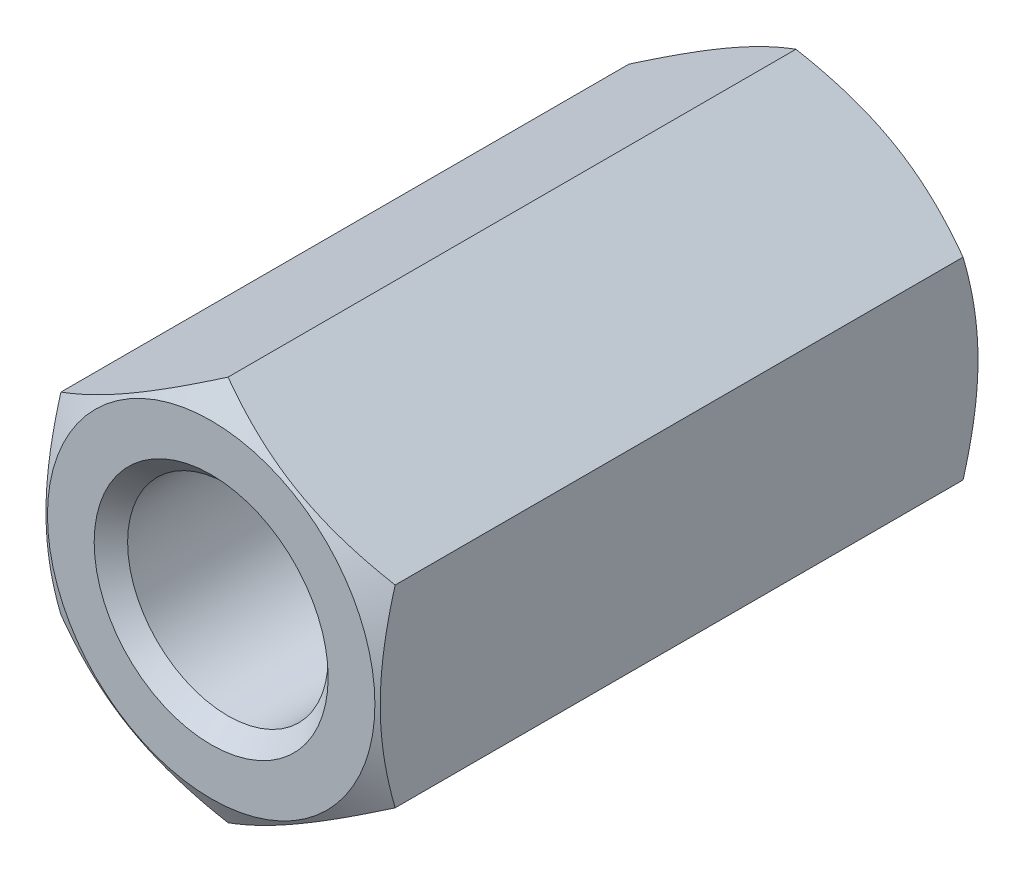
ISO-10303-21;
HEADER;
FILE_DESCRIPTION(('STEP AP214'),'2;1');
FILE_NAME('part.step','',(''),(''),'','','');
FILE_SCHEMA(('AUTOMOTIVE_DESIGN { 1 0 10303 214 1 1 1 1 }'));
ENDSEC;
DATA;
#1=APPLICATION_CONTEXT('core data for automotive mechanical design processes');
#2=APPLICATION_PROTOCOL_DEFINITION('international standard','automotive_design',2000,#1);
#3=PRODUCT_CONTEXT('',#1,'mechanical');
#4=PRODUCT('Part','Part','',(#3));
#5=PRODUCT_RELATED_PRODUCT_CATEGORY('part','',(#4));
#6=PRODUCT_DEFINITION_FORMATION('','',#4);
#7=PRODUCT_DEFINITION_CONTEXT('part definition',#1,'design');
#8=PRODUCT_DEFINITION('design','',#6,#7);
#9=PRODUCT_DEFINITION_SHAPE('','',#8);
#10=(LENGTH_UNIT() NAMED_UNIT(*) SI_UNIT(.MILLI.,.METRE.));
#11=(NAMED_UNIT(*) PLANE_ANGLE_UNIT() SI_UNIT($,.RADIAN.));
#12=(NAMED_UNIT(*) SI_UNIT($,.STERADIAN.) SOLID_ANGLE_UNIT());
#13=UNCERTAINTY_MEASURE_WITH_UNIT(LENGTH_MEASURE(1.E-05),#10,'distance_accuracy_value','');
#14=(GEOMETRIC_REPRESENTATION_CONTEXT(3) GLOBAL_UNCERTAINTY_ASSIGNED_CONTEXT((#13)) GLOBAL_UNIT_ASSIGNED_CONTEXT((#10,
#11,#12)) REPRESENTATION_CONTEXT('',''));
#15=CARTESIAN_POINT('',(0.,0.,0.));
#16=DIRECTION('',(0.,0.,1.));
#17=DIRECTION('',(1.,0.,0.));
#18=AXIS2_PLACEMENT_3D('',#15,#16,#17);
#19=CARTESIAN_POINT('',(5.,2.88675134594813,18.));
#20=DIRECTION('',(-0.5,-0.866025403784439,0.));
#21=DIRECTION('',(0.866025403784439,-0.5,0.));
#22=AXIS2_PLACEMENT_3D('',#19,#20,#21);
#23=PLANE('',#22);
#24=CARTESIAN_POINT('',(-0.00020000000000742,5.7736181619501,0.505248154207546));
#25=CARTESIAN_POINT('',(0.219534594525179,5.64675433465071,0.431986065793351));
#26=CARTESIAN_POINT('',(0.441148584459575,5.5188054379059,0.365350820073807));
#27=CARTESIAN_POINT('',(0.888213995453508,5.26069210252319,0.249038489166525));
#28=CARTESIAN_POINT('',(1.11367335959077,5.13052307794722,0.199402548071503));
#29=CARTESIAN_POINT('',(1.5618323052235,4.87177839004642,0.122150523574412));
#30=CARTESIAN_POINT('',(1.78446209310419,4.74324302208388,0.0940198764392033));
#31=CARTESIAN_POINT('',(2.11918990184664,4.54998783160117,0.0687944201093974));
#32=CARTESIAN_POINT('',(2.23084219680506,4.48552534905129,0.0632129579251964));
#33=CARTESIAN_POINT('',(2.45424997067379,4.35654081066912,0.0578017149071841));
#34=CARTESIAN_POINT('',(2.56600544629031,4.29201875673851,0.0579717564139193));
#35=CARTESIAN_POINT('',(2.87218423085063,4.11524635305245,0.0663531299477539));
#36=CARTESIAN_POINT('',(3.06650608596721,4.00305457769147,0.0804292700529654));
#37=CARTESIAN_POINT('',(3.4538601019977,3.77941563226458,0.125064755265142));
#38=CARTESIAN_POINT('',(3.64689090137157,3.66796924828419,0.15563935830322));
#39=CARTESIAN_POINT('',(4.03502534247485,3.44387972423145,0.232067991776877));
#40=CARTESIAN_POINT('',(4.23007999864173,3.33126486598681,0.278245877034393));
#41=CARTESIAN_POINT('',(4.61728034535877,3.10771464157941,0.383051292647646));
#42=CARTESIAN_POINT('',(4.80943099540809,2.99677641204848,0.441654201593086));
#43=CARTESIAN_POINT('',(5.0002,2.88663587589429,0.505248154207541));
#44=B_SPLINE_CURVE_WITH_KNOTS('',3,(#24,#25,#26,#27,#28,#29,#30,#31,#32,#33,#34,#35,#36,#37,#38,
#39,#40,#41,#42,#43),.UNSPECIFIED.,.F.,.F.,(4,2,2,2,2,2,2,2,2,4),(0.,0.792555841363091,
1.58701660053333,2.36181537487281,2.74884076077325,3.13585419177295,3.80962362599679,
4.4840172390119,5.17336882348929,5.86136694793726),.UNSPECIFIED.);
#45=CARTESIAN_POINT('',(0.,5.77350269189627,0.50518148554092));
#46=VERTEX_POINT('',#45);
#47=CARTESIAN_POINT('',(5.,2.88675134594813,0.505181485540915));
#48=VERTEX_POINT('',#47);
#49=EDGE_CURVE('E30',#46,#48,#44,.T.);
#50=ORIENTED_EDGE('',*,*,#49,.F.);
#51=DIRECTION('',(0.,0.,-1.));
#52=VECTOR('',#51,1.);
#53=CARTESIAN_POINT('',(0.,5.77350269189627,18.));
#54=LINE('',#53,#52);
#55=CARTESIAN_POINT('',(0.,5.77350269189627,17.4948185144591));
#56=VERTEX_POINT('',#55);
#57=EDGE_CURVE('E9',#56,#46,#54,.T.);
#58=ORIENTED_EDGE('',*,*,#57,.F.);
#59=CARTESIAN_POINT('',(5.0002,2.88663587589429,17.4947518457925));
#60=CARTESIAN_POINT('',(4.78046540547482,3.01349970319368,17.5680139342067));
#61=CARTESIAN_POINT('',(4.55885141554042,3.1414485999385,17.6346491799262));
#62=CARTESIAN_POINT('',(4.11178600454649,3.39956193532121,17.7509615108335));
#63=CARTESIAN_POINT('',(3.88632664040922,3.52973095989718,17.8005974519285));
#64=CARTESIAN_POINT('',(3.43816769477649,3.78847564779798,17.8778494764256));
#65=CARTESIAN_POINT('',(3.2155379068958,3.91701101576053,17.9059801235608));
#66=CARTESIAN_POINT('',(2.88081009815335,4.11026620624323,17.9312055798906));
#67=CARTESIAN_POINT('',(2.76915780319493,4.17472868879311,17.9367870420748));
#68=CARTESIAN_POINT('',(2.5457500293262,4.30371322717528,17.9421982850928));
#69=CARTESIAN_POINT('',(2.43399455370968,4.36823528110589,17.9420282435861));
#70=CARTESIAN_POINT('',(2.12781576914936,4.54500768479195,17.9336468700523));
#71=CARTESIAN_POINT('',(1.93349391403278,4.65719946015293,17.919570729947));
#72=CARTESIAN_POINT('',(1.54613989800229,4.88083840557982,17.8749352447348));
#73=CARTESIAN_POINT('',(1.35310909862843,4.99228478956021,17.8443606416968));
#74=CARTESIAN_POINT('',(0.964974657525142,5.21637431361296,17.7679320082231));
#75=CARTESIAN_POINT('',(0.76992000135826,5.32898917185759,17.7217541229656));
#76=CARTESIAN_POINT('',(0.382719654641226,5.55253939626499,17.6169487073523));
#77=CARTESIAN_POINT('',(0.190569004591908,5.66347762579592,17.5583457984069));
#78=CARTESIAN_POINT('',(-0.000200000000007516,5.7736181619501,17.4947518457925));
#79=B_SPLINE_CURVE_WITH_KNOTS('',3,(#59,#60,#61,#62,#63,#64,#65,#66,#67,#68,#69,#70,#71,#72,#73,
#74,#75,#76,#77,#78),.UNSPECIFIED.,.F.,.F.,(4,2,2,2,2,2,2,2,2,4),(0.,0.792555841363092,
1.58701660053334,2.36181537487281,2.74884076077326,3.13585419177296,3.8096236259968,
4.4840172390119,5.1733688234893,5.86136694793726),.UNSPECIFIED.);
#80=CARTESIAN_POINT('',(5.,2.88675134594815,17.4948185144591));
#81=VERTEX_POINT('',#80);
#82=EDGE_CURVE('E86',#81,#56,#79,.T.);
#83=ORIENTED_EDGE('',*,*,#82,.F.);
#84=DIRECTION('',(0.,0.,-1.));
#85=VECTOR('',#84,1.);
#86=CARTESIAN_POINT('',(5.,2.88675134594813,18.));
#87=LINE('',#86,#85);
#88=EDGE_CURVE('E79',#81,#48,#87,.T.);
#89=ORIENTED_EDGE('',*,*,#88,.T.);
#90=EDGE_LOOP('',(#50,#58,#83,#89));
#91=FACE_BOUND('',#90,.T.);
#92=ADVANCED_FACE('F14',(#91),#23,.F.);
#93=CARTESIAN_POINT('',(0.,5.77350269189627,18.));
#94=DIRECTION('',(0.5,-0.866025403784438,0.));
#95=DIRECTION('',(0.866025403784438,0.5,0.));
#96=AXIS2_PLACEMENT_3D('',#93,#94,#95);
#97=PLANE('',#96);
#98=CARTESIAN_POINT('',(-5.0002,2.88663587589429,0.505248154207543));
#99=CARTESIAN_POINT('',(-4.78046540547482,3.01349970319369,0.431986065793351));
#100=CARTESIAN_POINT('',(-4.55885141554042,3.1414485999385,0.365350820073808));
#101=CARTESIAN_POINT('',(-4.11178600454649,3.39956193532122,0.249038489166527));
#102=CARTESIAN_POINT('',(-3.88632664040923,3.52973095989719,0.199402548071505));
#103=CARTESIAN_POINT('',(-3.43816769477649,3.78847564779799,0.122150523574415));
#104=CARTESIAN_POINT('',(-3.21553790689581,3.91701101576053,0.0940198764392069));
#105=CARTESIAN_POINT('',(-2.88081009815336,4.11026620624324,0.0687944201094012));
#106=CARTESIAN_POINT('',(-2.76915780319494,4.17472868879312,0.0632129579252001));
#107=CARTESIAN_POINT('',(-2.5457500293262,4.30371322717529,0.0578017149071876));
#108=CARTESIAN_POINT('',(-2.43399455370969,4.3682352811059,0.0579717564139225));
#109=CARTESIAN_POINT('',(-2.12781576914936,4.54500768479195,0.0663531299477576));
#110=CARTESIAN_POINT('',(-1.93349391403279,4.65719946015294,0.0804292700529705));
#111=CARTESIAN_POINT('',(-1.5461398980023,4.88083840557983,0.125064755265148));
#112=CARTESIAN_POINT('',(-1.35310909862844,4.99228478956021,0.155639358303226));
#113=CARTESIAN_POINT('',(-0.964974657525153,5.21637431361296,0.232067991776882));
#114=CARTESIAN_POINT('',(-0.769920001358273,5.3289891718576,0.278245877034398));
#115=CARTESIAN_POINT('',(-0.382719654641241,5.55253939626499,0.383051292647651));
#116=CARTESIAN_POINT('',(-0.190569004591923,5.66347762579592,0.441654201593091));
#117=CARTESIAN_POINT('',(0.000199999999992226,5.7736181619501,0.505248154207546));
#118=B_SPLINE_CURVE_WITH_KNOTS('',3,(#98,#99,#100,#101,#102,#103,#104,#105,#106,#107,#108,#109,
#110,#111,#112,#113,#114,#115,#116,#117),.UNSPECIFIED.,.F.,.F.,(4,2,2,2,2,2,2,2,2,4),(0.,
0.792555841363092,1.58701660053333,2.36181537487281,2.74884076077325,3.13585419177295,
3.80962362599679,4.48401723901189,5.17336882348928,5.86136694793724),.UNSPECIFIED.);
#119=CARTESIAN_POINT('',(-5.,2.88675134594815,0.50518148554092));
#120=VERTEX_POINT('',#119);
#121=EDGE_CURVE('E66',#120,#46,#118,.T.);
#122=ORIENTED_EDGE('',*,*,#121,.F.);
#123=DIRECTION('',(0.,0.,-1.));
#124=VECTOR('',#123,1.);
#125=CARTESIAN_POINT('',(-5.,2.88675134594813,18.));
#126=LINE('',#125,#124);
#127=CARTESIAN_POINT('',(-5.,2.88675134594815,17.4948185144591));
#128=VERTEX_POINT('',#127);
#129=EDGE_CURVE('E23',#128,#120,#126,.T.);
#130=ORIENTED_EDGE('',*,*,#129,.F.);
#131=CARTESIAN_POINT('',(0.00019999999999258,5.7736181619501,17.4947518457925));
#132=CARTESIAN_POINT('',(-0.219534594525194,5.64675433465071,17.5680139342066));
#133=CARTESIAN_POINT('',(-0.44114858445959,5.51880543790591,17.6346491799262));
#134=CARTESIAN_POINT('',(-0.888213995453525,5.26069210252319,17.7509615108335));
#135=CARTESIAN_POINT('',(-1.11367335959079,5.13052307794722,17.8005974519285));
#136=CARTESIAN_POINT('',(-1.56183230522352,4.87177839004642,17.8778494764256));
#137=CARTESIAN_POINT('',(-1.7844620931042,4.74324302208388,17.9059801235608));
#138=CARTESIAN_POINT('',(-2.11918990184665,4.54998783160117,17.9312055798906));
#139=CARTESIAN_POINT('',(-2.23084219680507,4.48552534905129,17.9367870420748));
#140=CARTESIAN_POINT('',(-2.45424997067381,4.35654081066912,17.9421982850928));
#141=CARTESIAN_POINT('',(-2.56600544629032,4.29201875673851,17.9420282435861));
#142=CARTESIAN_POINT('',(-2.87218423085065,4.11524635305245,17.9336468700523));
#143=CARTESIAN_POINT('',(-3.06650608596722,4.00305457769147,17.919570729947));
#144=CARTESIAN_POINT('',(-3.45386010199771,3.77941563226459,17.8749352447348));
#145=CARTESIAN_POINT('',(-3.64689090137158,3.6679692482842,17.8443606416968));
#146=CARTESIAN_POINT('',(-4.03502534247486,3.44387972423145,17.7679320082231));
#147=CARTESIAN_POINT('',(-4.23007999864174,3.33126486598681,17.7217541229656));
#148=CARTESIAN_POINT('',(-4.61728034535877,3.10771464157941,17.6169487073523));
#149=CARTESIAN_POINT('',(-4.80943099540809,2.99677641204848,17.5583457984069));
#150=CARTESIAN_POINT('',(-5.0002,2.88663587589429,17.4947518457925));
#151=B_SPLINE_CURVE_WITH_KNOTS('',3,(#131,#132,#133,#134,#135,#136,#137,#138,#139,#140,#141,
#142,#143,#144,#145,#146,#147,#148,#149,#150),.UNSPECIFIED.,.F.,.F.,(4,2,2,2,2,2,2,2,2,4),(0.,
0.792555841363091,1.58701660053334,2.36181537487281,2.74884076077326,3.13585419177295,
3.80962362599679,4.48401723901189,5.17336882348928,5.86136694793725),.UNSPECIFIED.);
#152=EDGE_CURVE('E84',#56,#128,#151,.T.);
#153=ORIENTED_EDGE('',*,*,#152,.F.);
#154=ORIENTED_EDGE('',*,*,#57,.T.);
#155=EDGE_LOOP('',(#122,#130,#153,#154));
#156=FACE_BOUND('',#155,.T.);
#157=ADVANCED_FACE('F83',(#156),#97,.F.);
#158=CARTESIAN_POINT('',(-5.,2.88675134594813,18.));
#159=DIRECTION('',(1.,0.,0.));
#160=DIRECTION('',(0.,1.,0.));
#161=AXIS2_PLACEMENT_3D('',#158,#159,#160);
#162=PLANE('',#161);
#163=CARTESIAN_POINT('',(-5.,-7.64796514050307,2.44730613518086));
#164=CARTESIAN_POINT('',(-5.,-7.42850000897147,2.34128222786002));
#165=CARTESIAN_POINT('',(-5.00000000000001,-7.20851506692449,2.236314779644));
#166=CARTESIAN_POINT('',(-5.00000000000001,-6.7672244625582,2.02909668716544));
#167=CARTESIAN_POINT('',(-5.00000000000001,-6.54591857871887,1.92684651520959));
#168=CARTESIAN_POINT('',(-5.00000000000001,-6.1005054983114,1.72512642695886));
#169=CARTESIAN_POINT('',(-5.00000000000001,-5.87638951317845,1.62567584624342));
#170=CARTESIAN_POINT('',(-5.00000000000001,-5.42631248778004,1.43105805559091));
#171=CARTESIAN_POINT('',(-5.,-5.20035154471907,1.33589062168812));
#172=CARTESIAN_POINT('',(-5.,-4.74345800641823,1.14986406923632));
#173=CARTESIAN_POINT('',(-5.,-4.51249834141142,1.05907107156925));
#174=CARTESIAN_POINT('',(-5.,-4.04785175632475,0.884616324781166));
#175=CARTESIAN_POINT('',(-5.,-3.81416453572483,0.800955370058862));
#176=CARTESIAN_POINT('',(-5.,-3.34417457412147,0.643018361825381));
#177=CARTESIAN_POINT('',(-5.,-3.10787863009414,0.568722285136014));
#178=CARTESIAN_POINT('',(-5.,-2.63192544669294,0.431934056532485));
#179=CARTESIAN_POINT('',(-5.,-2.39226929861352,0.369438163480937));
#180=CARTESIAN_POINT('',(-5.,-1.90944023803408,0.259285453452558));
#181=CARTESIAN_POINT('',(-5.,-1.66626630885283,0.211633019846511));
#182=CARTESIAN_POINT('',(-5.,-1.17696169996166,0.134394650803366));
#183=CARTESIAN_POINT('',(-5.,-0.930831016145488,0.10480874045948));
#184=CARTESIAN_POINT('',(-5.,-0.561248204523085,0.0758765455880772));
#185=CARTESIAN_POINT('',(-5.,-0.438369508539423,0.0688052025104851));
#186=CARTESIAN_POINT('',(-5.,-0.192417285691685,0.059868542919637));
#187=CARTESIAN_POINT('',(-5.,-0.0693437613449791,0.0580031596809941));
#188=CARTESIAN_POINT('',(-5.,0.176735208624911,0.0595287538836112));
#189=CARTESIAN_POINT('',(-5.,0.299740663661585,0.0629182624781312));
#190=CARTESIAN_POINT('',(-5.,0.545502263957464,0.074868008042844));
#191=CARTESIAN_POINT('',(-5.,0.668258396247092,0.0834285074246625));
#192=CARTESIAN_POINT('',(-5.,0.966054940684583,0.110290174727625));
#193=CARTESIAN_POINT('',(-5.,1.14086404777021,0.131197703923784));
#194=CARTESIAN_POINT('',(-5.,1.48911279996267,0.182333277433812));
#195=CARTESIAN_POINT('',(-5.,1.66255225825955,0.212562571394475));
#196=CARTESIAN_POINT('',(-5.,2.00795437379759,0.281272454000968));
#197=CARTESIAN_POINT('',(-5.,2.17991537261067,0.319761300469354));
#198=CARTESIAN_POINT('',(-5.,2.52207129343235,0.403816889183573));
#199=CARTESIAN_POINT('',(-5.,2.69226632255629,0.449383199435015));
#200=CARTESIAN_POINT('',(-5.,3.03506218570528,0.547690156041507));
#201=CARTESIAN_POINT('',(-5.,3.2076202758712,0.600578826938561));
#202=CARTESIAN_POINT('',(-5.,3.55091234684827,0.711564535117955));
#203=CARTESIAN_POINT('',(-5.,3.72164749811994,0.769657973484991));
#204=CARTESIAN_POINT('',(-5.,4.06060843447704,0.88985469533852));
#205=CARTESIAN_POINT('',(-5.,4.22884293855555,0.951933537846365));
#206=CARTESIAN_POINT('',(-5.,4.56400815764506,1.07972371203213));
#207=CARTESIAN_POINT('',(-5.,4.73093831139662,1.14543651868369));
#208=CARTESIAN_POINT('',(-5.,4.89726279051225,1.21260644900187));
#209=B_SPLINE_CURVE_WITH_KNOTS('',3,(#163,#164,#165,#166,#167,#168,#169,#170,#171,#172,#173,
#174,#175,#176,#177,#178,#179,#180,#181,#182,#183,#184,#185,#186,#187,#188,#189,#190,#191,#192,
#193,#194,#195,#196,#197,#198,#199,#200,#201,#202,#203,#204,#205,#206,#207,#208),.UNSPECIFIED.,
.F.,.F.,(4,2,2,2,2,2,2,2,2,2,2,2,2,2,2,2,2,2,2,2,2,2,4),(0.,0.731210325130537,1.46254692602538,
2.19808288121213,2.93358033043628,3.67798361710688,4.42246971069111,5.16533598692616,
5.90796634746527,6.65081580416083,7.39366629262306,7.76281858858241,8.13196615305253,
8.5010105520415,8.87007368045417,9.39794425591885,9.92588562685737,10.4543573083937,
10.9827967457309,11.5241406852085,12.0651131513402,12.6030371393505,13.1411810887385),.UNSPECIFIED.);
#210=CARTESIAN_POINT('',(-5.,-2.88675134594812,0.50518148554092));
#211=VERTEX_POINT('',#210);
#212=EDGE_CURVE('E69',#211,#120,#209,.T.);
#213=ORIENTED_EDGE('',*,*,#212,.F.);
#214=DIRECTION('',(0.,0.,-1.));
#215=VECTOR('',#214,1.);
#216=CARTESIAN_POINT('',(-5.,-2.88675134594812,18.));
#217=LINE('',#216,#215);
#218=CARTESIAN_POINT('',(-5.,-2.88675134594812,17.4948185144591));
#219=VERTEX_POINT('',#218);
#220=EDGE_CURVE('E192',#219,#211,#217,.T.);
#221=ORIENTED_EDGE('',*,*,#220,.F.);
#222=CARTESIAN_POINT('',(-5.,-7.64796514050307,15.5526938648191));
#223=CARTESIAN_POINT('',(-5.,-7.42850000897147,15.65871777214));
#224=CARTESIAN_POINT('',(-5.00000000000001,-7.20851506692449,15.763685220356));
#225=CARTESIAN_POINT('',(-5.00000000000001,-6.76722446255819,15.9709033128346));
#226=CARTESIAN_POINT('',(-5.00000000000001,-6.54591857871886,16.0731534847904));
#227=CARTESIAN_POINT('',(-5.00000000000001,-6.10050549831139,16.2748735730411));
#228=CARTESIAN_POINT('',(-5.00000000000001,-5.87638951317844,16.3743241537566));
#229=CARTESIAN_POINT('',(-5.00000000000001,-5.42631248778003,16.5689419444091));
#230=CARTESIAN_POINT('',(-5.,-5.20035154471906,16.6641093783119));
#231=CARTESIAN_POINT('',(-5.,-4.74345800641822,16.8501359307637));
#232=CARTESIAN_POINT('',(-5.,-4.51249834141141,16.9409289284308));
#233=CARTESIAN_POINT('',(-5.,-4.04785175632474,17.1153836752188));
#234=CARTESIAN_POINT('',(-5.,-3.81416453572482,17.1990446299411));
#235=CARTESIAN_POINT('',(-5.,-3.34417457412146,17.3569816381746));
#236=CARTESIAN_POINT('',(-5.,-3.10787863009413,17.431277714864));
#237=CARTESIAN_POINT('',(-5.,-2.63192544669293,17.5680659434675));
#238=CARTESIAN_POINT('',(-5.,-2.39226929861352,17.6305618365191));
#239=CARTESIAN_POINT('',(-5.,-1.90944023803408,17.7407145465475));
#240=CARTESIAN_POINT('',(-5.,-1.66626630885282,17.7883669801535));
#241=CARTESIAN_POINT('',(-5.,-1.17696169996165,17.8656053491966));
#242=CARTESIAN_POINT('',(-5.,-0.930831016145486,17.8951912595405));
#243=CARTESIAN_POINT('',(-5.,-0.561248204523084,17.9241234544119));
#244=CARTESIAN_POINT('',(-5.,-0.438369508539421,17.9311947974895));
#245=CARTESIAN_POINT('',(-5.,-0.192417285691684,17.9401314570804));
#246=CARTESIAN_POINT('',(-5.,-0.0693437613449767,17.941996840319));
#247=CARTESIAN_POINT('',(-5.,0.176735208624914,17.9404712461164));
#248=CARTESIAN_POINT('',(-5.,0.299740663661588,17.9370817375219));
#249=CARTESIAN_POINT('',(-5.,0.545502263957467,17.9251319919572));
#250=CARTESIAN_POINT('',(-5.,0.668258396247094,17.9165714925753));
#251=CARTESIAN_POINT('',(-5.,0.966054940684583,17.8897098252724));
#252=CARTESIAN_POINT('',(-5.,1.14086404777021,17.8688022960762));
#253=CARTESIAN_POINT('',(-5.,1.48911279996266,17.8176667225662));
#254=CARTESIAN_POINT('',(-5.,1.66255225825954,17.7874374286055));
#255=CARTESIAN_POINT('',(-5.,2.00795437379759,17.718727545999));
#256=CARTESIAN_POINT('',(-5.,2.17991537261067,17.6802386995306));
#257=CARTESIAN_POINT('',(-5.,2.52207129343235,17.5961831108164));
#258=CARTESIAN_POINT('',(-5.,2.69226632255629,17.550616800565));
#259=CARTESIAN_POINT('',(-5.,3.03506218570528,17.4523098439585));
#260=CARTESIAN_POINT('',(-5.,3.20762027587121,17.3994211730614));
#261=CARTESIAN_POINT('',(-5.,3.55091234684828,17.288435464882));
#262=CARTESIAN_POINT('',(-5.,3.72164749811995,17.230342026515));
#263=CARTESIAN_POINT('',(-5.,4.06060843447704,17.1101453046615));
#264=CARTESIAN_POINT('',(-5.,4.22884293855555,17.0480664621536));
#265=CARTESIAN_POINT('',(-5.,4.56400815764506,16.9202762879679));
#266=CARTESIAN_POINT('',(-5.,4.73093831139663,16.8545634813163));
#267=CARTESIAN_POINT('',(-5.,4.89726279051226,16.7873935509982));
#268=B_SPLINE_CURVE_WITH_KNOTS('',3,(#222,#223,#224,#225,#226,#227,#228,#229,#230,#231,#232,
#233,#234,#235,#236,#237,#238,#239,#240,#241,#242,#243,#244,#245,#246,#247,#248,#249,#250,#251,
#252,#253,#254,#255,#256,#257,#258,#259,#260,#261,#262,#263,#264,#265,#266,#267),.UNSPECIFIED.,
.F.,.F.,(4,2,2,2,2,2,2,2,2,2,2,2,2,2,2,2,2,2,2,2,2,2,4),(0.,0.731210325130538,1.46254692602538,
2.19808288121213,2.93358033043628,3.67798361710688,4.42246971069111,5.16533598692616,
5.90796634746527,6.65081580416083,7.39366629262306,7.76281858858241,8.13196615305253,
8.5010105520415,8.87007368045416,9.39794425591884,9.92588562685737,10.4543573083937,
10.9827967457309,11.5241406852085,12.0651131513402,12.6030371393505,13.1411810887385),.UNSPECIFIED.);
#269=EDGE_CURVE('E87',#128,#219,#268,.F.);
#270=ORIENTED_EDGE('',*,*,#269,.F.);
#271=ORIENTED_EDGE('',*,*,#129,.T.);
#272=EDGE_LOOP('',(#213,#221,#270,#271));
#273=FACE_BOUND('',#272,.T.);
#274=ADVANCED_FACE('F148',(#273),#162,.F.);
#275=CARTESIAN_POINT('',(-5.,-2.88675134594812,18.));
#276=DIRECTION('',(0.5,0.866025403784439,0.));
#277=DIRECTION('',(-0.866025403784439,0.5,0.));
#278=AXIS2_PLACEMENT_3D('',#275,#276,#277);
#279=PLANE('',#278);
#280=CARTESIAN_POINT('',(0.000199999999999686,-5.77361816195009,0.50524815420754));
#281=CARTESIAN_POINT('',(-0.219534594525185,-5.6467543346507,0.431986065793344));
#282=CARTESIAN_POINT('',(-0.44114858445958,-5.51880543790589,0.3653508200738));
#283=CARTESIAN_POINT('',(-0.888213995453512,-5.26069210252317,0.249038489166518));
#284=CARTESIAN_POINT('',(-1.11367335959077,-5.13052307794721,0.199402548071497));
#285=CARTESIAN_POINT('',(-1.56183230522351,-4.87177839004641,0.122150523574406));
#286=CARTESIAN_POINT('',(-1.78446209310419,-4.74324302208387,0.094019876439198));
#287=CARTESIAN_POINT('',(-2.11918990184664,-4.54998783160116,0.0687944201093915));
#288=CARTESIAN_POINT('',(-2.23084219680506,-4.48552534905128,0.0632129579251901));
#289=CARTESIAN_POINT('',(-2.4542499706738,-4.35654081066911,0.0578017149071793));
#290=CARTESIAN_POINT('',(-2.56600544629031,-4.2920187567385,0.0579717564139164));
#291=CARTESIAN_POINT('',(-2.87218423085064,-4.11524635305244,0.0663531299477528));
#292=CARTESIAN_POINT('',(-3.06650608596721,-4.00305457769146,0.0804292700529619));
#293=CARTESIAN_POINT('',(-3.45386010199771,-3.77941563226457,0.125064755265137));
#294=CARTESIAN_POINT('',(-3.64689090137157,-3.66796924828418,0.155639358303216));
#295=CARTESIAN_POINT('',(-4.03502534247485,-3.44387972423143,0.232067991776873));
#296=CARTESIAN_POINT('',(-4.23007999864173,-3.3312648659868,0.278245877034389));
#297=CARTESIAN_POINT('',(-4.61728034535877,-3.1077146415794,0.383051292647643));
#298=CARTESIAN_POINT('',(-4.80943099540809,-2.99677641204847,0.441654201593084));
#299=CARTESIAN_POINT('',(-5.0002,-2.88663587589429,0.505248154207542));
#300=B_SPLINE_CURVE_WITH_KNOTS('',3,(#280,#281,#282,#283,#284,#285,#286,#287,#288,#289,#290,
#291,#292,#293,#294,#295,#296,#297,#298,#299),.UNSPECIFIED.,.F.,.F.,(4,2,2,2,2,2,2,2,2,4),(0.,
0.79255584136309,1.58701660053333,2.3618153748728,2.74884076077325,3.13585419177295,
3.80962362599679,4.48401723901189,5.17336882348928,5.86136694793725),.UNSPECIFIED.);
#301=CARTESIAN_POINT('',(0.,-5.77350269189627,0.50518148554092));
#302=VERTEX_POINT('',#301);
#303=EDGE_CURVE('E154',#302,#211,#300,.T.);
#304=ORIENTED_EDGE('',*,*,#303,.F.);
#305=DIRECTION('',(0.,0.,-1.));
#306=VECTOR('',#305,1.);
#307=CARTESIAN_POINT('',(0.,-5.77350269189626,18.));
#308=LINE('',#307,#306);
#309=CARTESIAN_POINT('',(0.,-5.77350269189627,17.4948185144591));
#310=VERTEX_POINT('',#309);
#311=EDGE_CURVE('E187',#310,#302,#308,.T.);
#312=ORIENTED_EDGE('',*,*,#311,.F.);
#313=CARTESIAN_POINT('',(-5.0002,-2.88663587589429,17.4947518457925));
#314=CARTESIAN_POINT('',(-4.78046540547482,-3.01349970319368,17.5680139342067));
#315=CARTESIAN_POINT('',(-4.55885141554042,-3.14144859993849,17.6346491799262));
#316=CARTESIAN_POINT('',(-4.11178600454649,-3.3995619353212,17.7509615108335));
#317=CARTESIAN_POINT('',(-3.88632664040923,-3.52973095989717,17.8005974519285));
#318=CARTESIAN_POINT('',(-3.43816769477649,-3.78847564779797,17.8778494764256));
#319=CARTESIAN_POINT('',(-3.21553790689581,-3.91701101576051,17.9059801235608));
#320=CARTESIAN_POINT('',(-2.88081009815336,-4.11026620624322,17.9312055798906));
#321=CARTESIAN_POINT('',(-2.76915780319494,-4.1747286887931,17.9367870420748));
#322=CARTESIAN_POINT('',(-2.54575002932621,-4.30371322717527,17.9421982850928));
#323=CARTESIAN_POINT('',(-2.43399455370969,-4.36823528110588,17.9420282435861));
#324=CARTESIAN_POINT('',(-2.12781576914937,-4.54500768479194,17.9336468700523));
#325=CARTESIAN_POINT('',(-1.93349391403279,-4.65719946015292,17.919570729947));
#326=CARTESIAN_POINT('',(-1.5461398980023,-4.8808384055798,17.8749352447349));
#327=CARTESIAN_POINT('',(-1.35310909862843,-4.9922847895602,17.8443606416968));
#328=CARTESIAN_POINT('',(-0.964974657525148,-5.21637431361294,17.7679320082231));
#329=CARTESIAN_POINT('',(-0.769920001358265,-5.32898917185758,17.7217541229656));
#330=CARTESIAN_POINT('',(-0.382719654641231,-5.55253939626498,17.6169487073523));
#331=CARTESIAN_POINT('',(-0.190569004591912,-5.66347762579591,17.5583457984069));
#332=CARTESIAN_POINT('',(0.000200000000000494,-5.77361816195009,17.4947518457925));
#333=B_SPLINE_CURVE_WITH_KNOTS('',3,(#313,#314,#315,#316,#317,#318,#319,#320,#321,#322,#323,
#324,#325,#326,#327,#328,#329,#330,#331,#332),.UNSPECIFIED.,.F.,.F.,(4,2,2,2,2,2,2,2,2,4),(0.,
0.79255584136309,1.58701660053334,2.3618153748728,2.74884076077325,3.13585419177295,
3.80962362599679,4.48401723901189,5.17336882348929,5.86136694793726),.UNSPECIFIED.);
#334=EDGE_CURVE('E90',#219,#310,#333,.T.);
#335=ORIENTED_EDGE('',*,*,#334,.F.);
#336=ORIENTED_EDGE('',*,*,#220,.T.);
#337=EDGE_LOOP('',(#304,#312,#335,#336));
#338=FACE_BOUND('',#337,.T.);
#339=ADVANCED_FACE('F144',(#338),#279,.F.);
#340=CARTESIAN_POINT('',(0.,-5.77350269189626,18.));
#341=DIRECTION('',(-0.5,0.866025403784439,0.));
#342=DIRECTION('',(-0.866025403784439,-0.5,0.));
#343=AXIS2_PLACEMENT_3D('',#340,#341,#342);
#344=PLANE('',#343);
#345=CARTESIAN_POINT('',(5.0002,-2.88663587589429,0.505248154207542));
#346=CARTESIAN_POINT('',(4.78046540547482,-3.01349970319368,0.431986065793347));
#347=CARTESIAN_POINT('',(4.55885141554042,-3.14144859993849,0.365350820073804));
#348=CARTESIAN_POINT('',(4.11178600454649,-3.39956193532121,0.249038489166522));
#349=CARTESIAN_POINT('',(3.88632664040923,-3.52973095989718,0.1994025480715));
#350=CARTESIAN_POINT('',(3.43816769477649,-3.78847564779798,0.12215052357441));
#351=CARTESIAN_POINT('',(3.21553790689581,-3.91701101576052,0.0940198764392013));
#352=CARTESIAN_POINT('',(2.88081009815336,-4.11026620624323,0.0687944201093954));
#353=CARTESIAN_POINT('',(2.76915780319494,-4.17472868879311,0.0632129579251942));
#354=CARTESIAN_POINT('',(2.5457500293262,-4.30371322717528,0.0578017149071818));
#355=CARTESIAN_POINT('',(2.43399455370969,-4.36823528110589,0.0579717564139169));
#356=CARTESIAN_POINT('',(2.12781576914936,-4.54500768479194,0.066353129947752));
#357=CARTESIAN_POINT('',(1.93349391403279,-4.65719946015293,0.0804292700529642));
#358=CARTESIAN_POINT('',(1.5461398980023,-4.88083840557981,0.125064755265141));
#359=CARTESIAN_POINT('',(1.35310909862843,-4.9922847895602,0.155639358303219));
#360=CARTESIAN_POINT('',(0.964974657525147,-5.21637431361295,0.232067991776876));
#361=CARTESIAN_POINT('',(0.769920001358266,-5.32898917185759,0.278245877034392));
#362=CARTESIAN_POINT('',(0.382719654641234,-5.55253939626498,0.383051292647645));
#363=CARTESIAN_POINT('',(0.190569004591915,-5.66347762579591,0.441654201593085));
#364=CARTESIAN_POINT('',(-0.000200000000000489,-5.77361816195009,0.50524815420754));
#365=B_SPLINE_CURVE_WITH_KNOTS('',3,(#345,#346,#347,#348,#349,#350,#351,#352,#353,#354,#355,
#356,#357,#358,#359,#360,#361,#362,#363,#364),.UNSPECIFIED.,.F.,.F.,(4,2,2,2,2,2,2,2,2,4),(0.,
0.792555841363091,1.58701660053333,2.36181537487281,2.74884076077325,3.13585419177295,
3.80962362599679,4.48401723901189,5.17336882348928,5.86136694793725),.UNSPECIFIED.);
#366=CARTESIAN_POINT('',(5.,-2.88675134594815,0.50518148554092));
#367=VERTEX_POINT('',#366);
#368=EDGE_CURVE('E161',#367,#302,#365,.T.);
#369=ORIENTED_EDGE('',*,*,#368,.F.);
#370=DIRECTION('',(0.,0.,-1.));
#371=VECTOR('',#370,1.);
#372=CARTESIAN_POINT('',(5.,-2.88675134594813,18.));
#373=LINE('',#372,#371);
#374=CARTESIAN_POINT('',(5.,-2.88675134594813,17.4948185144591));
#375=VERTEX_POINT('',#374);
#376=EDGE_CURVE('E186',#375,#367,#373,.T.);
#377=ORIENTED_EDGE('',*,*,#376,.F.);
#378=CARTESIAN_POINT('',(-0.000200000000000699,-5.77361816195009,17.4947518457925));
#379=CARTESIAN_POINT('',(0.219534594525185,-5.6467543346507,17.5680139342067));
#380=CARTESIAN_POINT('',(0.441148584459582,-5.5188054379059,17.6346491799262));
#381=CARTESIAN_POINT('',(0.888213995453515,-5.26069210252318,17.7509615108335));
#382=CARTESIAN_POINT('',(1.11367335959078,-5.13052307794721,17.8005974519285));
#383=CARTESIAN_POINT('',(1.56183230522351,-4.87177839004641,17.8778494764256));
#384=CARTESIAN_POINT('',(1.78446209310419,-4.74324302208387,17.9059801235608));
#385=CARTESIAN_POINT('',(2.11918990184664,-4.54998783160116,17.9312055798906));
#386=CARTESIAN_POINT('',(2.23084219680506,-4.48552534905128,17.9367870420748));
#387=CARTESIAN_POINT('',(2.4542499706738,-4.35654081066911,17.9421982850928));
#388=CARTESIAN_POINT('',(2.56600544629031,-4.2920187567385,17.9420282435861));
#389=CARTESIAN_POINT('',(2.87218423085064,-4.11524635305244,17.9336468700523));
#390=CARTESIAN_POINT('',(3.06650608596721,-4.00305457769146,17.919570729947));
#391=CARTESIAN_POINT('',(3.4538601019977,-3.77941563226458,17.8749352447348));
#392=CARTESIAN_POINT('',(3.64689090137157,-3.66796924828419,17.8443606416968));
#393=CARTESIAN_POINT('',(4.03502534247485,-3.44387972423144,17.7679320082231));
#394=CARTESIAN_POINT('',(4.23007999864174,-3.3312648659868,17.7217541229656));
#395=CARTESIAN_POINT('',(4.61728034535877,-3.10771464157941,17.6169487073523));
#396=CARTESIAN_POINT('',(4.80943099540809,-2.99677641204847,17.5583457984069));
#397=CARTESIAN_POINT('',(5.0002,-2.88663587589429,17.4947518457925));
#398=B_SPLINE_CURVE_WITH_KNOTS('',3,(#378,#379,#380,#381,#382,#383,#384,#385,#386,#387,#388,
#389,#390,#391,#392,#393,#394,#395,#396,#397),.UNSPECIFIED.,.F.,.F.,(4,2,2,2,2,2,2,2,2,4),(0.,
0.792555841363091,1.58701660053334,2.36181537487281,2.74884076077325,3.13585419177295,
3.80962362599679,4.48401723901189,5.17336882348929,5.86136694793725),.UNSPECIFIED.);
#399=EDGE_CURVE('E38',#310,#375,#398,.T.);
#400=ORIENTED_EDGE('',*,*,#399,.F.);
#401=ORIENTED_EDGE('',*,*,#311,.T.);
#402=EDGE_LOOP('',(#369,#377,#400,#401));
#403=FACE_BOUND('',#402,.T.);
#404=ADVANCED_FACE('F147',(#403),#344,.F.);
#405=CARTESIAN_POINT('',(5.,-2.88675134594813,18.));
#406=DIRECTION('',(-1.,0.,0.));
#407=DIRECTION('',(0.,-1.,0.));
#408=AXIS2_PLACEMENT_3D('',#405,#406,#407);
#409=PLANE('',#408);
#410=CARTESIAN_POINT('',(5.,-7.64796514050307,2.44730613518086));
#411=CARTESIAN_POINT('',(5.,-7.42850000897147,2.34128222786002));
#412=CARTESIAN_POINT('',(5.,-7.20851506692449,2.236314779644));
#413=CARTESIAN_POINT('',(5.,-6.7672244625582,2.02909668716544));
#414=CARTESIAN_POINT('',(5.,-6.54591857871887,1.92684651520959));
#415=CARTESIAN_POINT('',(5.,-6.1005054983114,1.72512642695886));
#416=CARTESIAN_POINT('',(5.,-5.87638951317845,1.62567584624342));
#417=CARTESIAN_POINT('',(5.,-5.42631248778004,1.43105805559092));
#418=CARTESIAN_POINT('',(5.,-5.20035154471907,1.33589062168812));
#419=CARTESIAN_POINT('',(5.,-4.74345800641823,1.14986406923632));
#420=CARTESIAN_POINT('',(5.,-4.51249834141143,1.05907107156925));
#421=CARTESIAN_POINT('',(5.,-4.04785175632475,0.884616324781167));
#422=CARTESIAN_POINT('',(5.,-3.81416453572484,0.800955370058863));
#423=CARTESIAN_POINT('',(5.,-3.34417457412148,0.643018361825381));
#424=CARTESIAN_POINT('',(5.,-3.10787863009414,0.568722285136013));
#425=CARTESIAN_POINT('',(5.,-2.63192544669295,0.431934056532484));
#426=CARTESIAN_POINT('',(5.,-2.39226929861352,0.369438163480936));
#427=CARTESIAN_POINT('',(5.,-1.90944023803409,0.259285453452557));
#428=CARTESIAN_POINT('',(5.,-1.66626630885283,0.211633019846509));
#429=CARTESIAN_POINT('',(5.,-1.17696169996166,0.134394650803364));
#430=CARTESIAN_POINT('',(5.,-0.930831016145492,0.104808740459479));
#431=CARTESIAN_POINT('',(5.,-0.56124820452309,0.0758765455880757));
#432=CARTESIAN_POINT('',(5.,-0.438369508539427,0.0688052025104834));
#433=CARTESIAN_POINT('',(5.,-0.19241728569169,0.0598685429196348));
#434=CARTESIAN_POINT('',(5.,-0.0693437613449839,0.0580031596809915));
#435=CARTESIAN_POINT('',(5.,0.176735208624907,0.0595287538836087));
#436=CARTESIAN_POINT('',(5.,0.299740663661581,0.0629182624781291));
#437=CARTESIAN_POINT('',(5.,0.545502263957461,0.074868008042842));
#438=CARTESIAN_POINT('',(5.,0.668258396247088,0.0834285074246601));
#439=CARTESIAN_POINT('',(5.,0.966054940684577,0.110290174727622));
#440=CARTESIAN_POINT('',(5.,1.1408640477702,0.131197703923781));
#441=CARTESIAN_POINT('',(5.,1.48911279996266,0.182333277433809));
#442=CARTESIAN_POINT('',(5.,1.66255225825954,0.212562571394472));
#443=CARTESIAN_POINT('',(5.,2.00795437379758,0.281272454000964));
#444=CARTESIAN_POINT('',(5.,2.17991537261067,0.31976130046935));
#445=CARTESIAN_POINT('',(5.,2.52207129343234,0.403816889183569));
#446=CARTESIAN_POINT('',(5.,2.69226632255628,0.449383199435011));
#447=CARTESIAN_POINT('',(5.,3.03506218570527,0.547690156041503));
#448=CARTESIAN_POINT('',(5.,3.20762027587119,0.600578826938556));
#449=CARTESIAN_POINT('',(5.,3.55091234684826,0.71156453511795));
#450=CARTESIAN_POINT('',(5.,3.72164749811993,0.769657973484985));
#451=CARTESIAN_POINT('',(5.,4.06060843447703,0.889854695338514));
#452=CARTESIAN_POINT('',(4.99999999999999,4.22884293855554,0.95193353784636));
#453=CARTESIAN_POINT('',(5.,4.56400815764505,1.07972371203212));
#454=CARTESIAN_POINT('',(5.,4.73093831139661,1.14543651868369));
#455=CARTESIAN_POINT('',(5.,4.89726279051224,1.21260644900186));
#456=B_SPLINE_CURVE_WITH_KNOTS('',3,(#410,#411,#412,#413,#414,#415,#416,#417,#418,#419,#420,
#421,#422,#423,#424,#425,#426,#427,#428,#429,#430,#431,#432,#433,#434,#435,#436,#437,#438,#439,
#440,#441,#442,#443,#444,#445,#446,#447,#448,#449,#450,#451,#452,#453,#454,#455),.UNSPECIFIED.,
.F.,.F.,(4,2,2,2,2,2,2,2,2,2,2,2,2,2,2,2,2,2,2,2,2,2,4),(0.,0.731210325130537,1.46254692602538,
2.19808288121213,2.93358033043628,3.67798361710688,4.4224697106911,5.16533598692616,
5.90796634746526,6.65081580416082,7.39366629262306,7.7628185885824,8.13196615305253,
8.5010105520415,8.87007368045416,9.39794425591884,9.92588562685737,10.4543573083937,
10.9827967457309,11.5241406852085,12.0651131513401,12.6030371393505,13.1411810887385),.UNSPECIFIED.);
#457=EDGE_CURVE('E185',#48,#367,#456,.F.);
#458=ORIENTED_EDGE('',*,*,#457,.F.);
#459=ORIENTED_EDGE('',*,*,#88,.F.);
#460=CARTESIAN_POINT('',(5.,-7.64796514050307,15.5526938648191));
#461=CARTESIAN_POINT('',(5.,-7.42850000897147,15.65871777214));
#462=CARTESIAN_POINT('',(5.,-7.20851506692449,15.763685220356));
#463=CARTESIAN_POINT('',(5.,-6.7672244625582,15.9709033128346));
#464=CARTESIAN_POINT('',(5.,-6.54591857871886,16.0731534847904));
#465=CARTESIAN_POINT('',(5.,-6.1005054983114,16.2748735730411));
#466=CARTESIAN_POINT('',(5.,-5.87638951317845,16.3743241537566));
#467=CARTESIAN_POINT('',(5.,-5.42631248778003,16.5689419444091));
#468=CARTESIAN_POINT('',(5.,-5.20035154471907,16.6641093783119));
#469=CARTESIAN_POINT('',(5.,-4.74345800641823,16.8501359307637));
#470=CARTESIAN_POINT('',(5.,-4.51249834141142,16.9409289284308));
#471=CARTESIAN_POINT('',(5.,-4.04785175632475,17.1153836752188));
#472=CARTESIAN_POINT('',(5.,-3.81416453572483,17.1990446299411));
#473=CARTESIAN_POINT('',(5.,-3.34417457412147,17.3569816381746));
#474=CARTESIAN_POINT('',(5.,-3.10787863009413,17.431277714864));
#475=CARTESIAN_POINT('',(5.,-2.63192544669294,17.5680659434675));
#476=CARTESIAN_POINT('',(5.,-2.39226929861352,17.6305618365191));
#477=CARTESIAN_POINT('',(5.,-1.90944023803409,17.7407145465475));
#478=CARTESIAN_POINT('',(5.,-1.66626630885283,17.7883669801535));
#479=CARTESIAN_POINT('',(5.,-1.17696169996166,17.8656053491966));
#480=CARTESIAN_POINT('',(5.,-0.930831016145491,17.8951912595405));
#481=CARTESIAN_POINT('',(5.,-0.561248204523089,17.9241234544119));
#482=CARTESIAN_POINT('',(5.,-0.438369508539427,17.9311947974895));
#483=CARTESIAN_POINT('',(5.,-0.19241728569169,17.9401314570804));
#484=CARTESIAN_POINT('',(5.,-0.0693437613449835,17.941996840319));
#485=CARTESIAN_POINT('',(5.,0.176735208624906,17.9404712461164));
#486=CARTESIAN_POINT('',(5.,0.29974066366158,17.9370817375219));
#487=CARTESIAN_POINT('',(5.,0.54550226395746,17.9251319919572));
#488=CARTESIAN_POINT('',(5.,0.668258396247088,17.9165714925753));
#489=CARTESIAN_POINT('',(5.,0.966054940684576,17.8897098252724));
#490=CARTESIAN_POINT('',(5.,1.1408640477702,17.8688022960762));
#491=CARTESIAN_POINT('',(5.,1.48911279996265,17.8176667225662));
#492=CARTESIAN_POINT('',(5.,1.66255225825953,17.7874374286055));
#493=CARTESIAN_POINT('',(5.,2.00795437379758,17.718727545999));
#494=CARTESIAN_POINT('',(5.,2.17991537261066,17.6802386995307));
#495=CARTESIAN_POINT('',(5.,2.52207129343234,17.5961831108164));
#496=CARTESIAN_POINT('',(5.,2.69226632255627,17.550616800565));
#497=CARTESIAN_POINT('',(5.,3.03506218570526,17.4523098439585));
#498=CARTESIAN_POINT('',(5.,3.20762027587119,17.3994211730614));
#499=CARTESIAN_POINT('',(5.,3.55091234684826,17.288435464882));
#500=CARTESIAN_POINT('',(5.,3.72164749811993,17.230342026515));
#501=CARTESIAN_POINT('',(5.,4.06060843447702,17.1101453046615));
#502=CARTESIAN_POINT('',(4.99999999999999,4.22884293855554,17.0480664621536));
#503=CARTESIAN_POINT('',(5.,4.56400815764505,16.9202762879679));
#504=CARTESIAN_POINT('',(5.,4.73093831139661,16.8545634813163));
#505=CARTESIAN_POINT('',(5.,4.89726279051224,16.7873935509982));
#506=B_SPLINE_CURVE_WITH_KNOTS('',3,(#460,#461,#462,#463,#464,#465,#466,#467,#468,#469,#470,
#471,#472,#473,#474,#475,#476,#477,#478,#479,#480,#481,#482,#483,#484,#485,#486,#487,#488,#489,
#490,#491,#492,#493,#494,#495,#496,#497,#498,#499,#500,#501,#502,#503,#504,#505),.UNSPECIFIED.,
.F.,.F.,(4,2,2,2,2,2,2,2,2,2,2,2,2,2,2,2,2,2,2,2,2,2,4),(0.,0.731210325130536,1.46254692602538,
2.19808288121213,2.93358033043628,3.67798361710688,4.4224697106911,5.16533598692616,
5.90796634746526,6.65081580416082,7.39366629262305,7.7628185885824,8.13196615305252,
8.5010105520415,8.87007368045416,9.39794425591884,9.92588562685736,10.4543573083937,
10.9827967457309,11.5241406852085,12.0651131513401,12.6030371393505,13.1411810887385),.UNSPECIFIED.);
#507=EDGE_CURVE('E123',#375,#81,#506,.T.);
#508=ORIENTED_EDGE('',*,*,#507,.F.);
#509=ORIENTED_EDGE('',*,*,#376,.T.);
#510=EDGE_LOOP('',(#458,#459,#508,#509));
#511=FACE_BOUND('',#510,.T.);
#512=ADVANCED_FACE('F115',(#511),#409,.F.);
#513=CARTESIAN_POINT('',(0.,0.,18.));
#514=DIRECTION('',(0.,0.,-1.));
#515=DIRECTION('',(-1.,0.,0.));
#516=AXIS2_PLACEMENT_3D('',#513,#514,#515);
#517=CONICAL_SURFACE('',#516,4.89850269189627,1.0471975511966);
#518=CARTESIAN_POINT('',(0.,0.,18.));
#519=DIRECTION('',(0.,0.,1.));
#520=DIRECTION('',(1.,0.,0.));
#521=AXIS2_PLACEMENT_3D('',#518,#519,#520);
#522=CIRCLE('',#521,4.89850269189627);
#523=CARTESIAN_POINT('',(4.89850269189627,0.,18.));
#524=VERTEX_POINT('',#523);
#525=EDGE_CURVE('E80',#524,#524,#522,.T.);
#526=ORIENTED_EDGE('',*,*,#525,.F.);
#527=EDGE_LOOP('',(#526));
#528=FACE_BOUND('',#527,.T.);
#529=ORIENTED_EDGE('',*,*,#82,.T.);
#530=ORIENTED_EDGE('',*,*,#152,.T.);
#531=ORIENTED_EDGE('',*,*,#269,.T.);
#532=ORIENTED_EDGE('',*,*,#334,.T.);
#533=ORIENTED_EDGE('',*,*,#399,.T.);
#534=ORIENTED_EDGE('',*,*,#507,.T.);
#535=EDGE_LOOP('',(#529,#530,#531,#532,#533,#534));
#536=FACE_BOUND('',#535,.T.);
#537=ADVANCED_FACE('F109',(#528,#536),#517,.T.);
#538=CARTESIAN_POINT('',(0.,5.77350269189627,18.));
#539=DIRECTION('',(0.,0.,1.));
#540=DIRECTION('',(1.,0.,0.));
#541=AXIS2_PLACEMENT_3D('',#538,#539,#540);
#542=PLANE('',#541);
#543=CARTESIAN_POINT('',(0.,0.,18.));
#544=DIRECTION('',(0.,0.,1.));
#545=DIRECTION('',(1.,0.,0.));
#546=AXIS2_PLACEMENT_3D('',#543,#544,#545);
#547=CIRCLE('',#546,3.5);
#548=CARTESIAN_POINT('',(3.5,0.,18.));
#549=VERTEX_POINT('',#548);
#550=EDGE_CURVE('E317',#549,#549,#547,.T.);
#551=ORIENTED_EDGE('',*,*,#550,.F.);
#552=EDGE_LOOP('',(#551));
#553=FACE_BOUND('',#552,.T.);
#554=ORIENTED_EDGE('',*,*,#525,.T.);
#555=EDGE_LOOP('',(#554));
#556=FACE_BOUND('',#555,.T.);
#557=ADVANCED_FACE('F114',(#553,#556),#542,.T.);
#558=CARTESIAN_POINT('',(0.,0.,0.50518148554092));
#559=DIRECTION('',(0.,0.,1.));
#560=DIRECTION('',(1.,0.,0.));
#561=AXIS2_PLACEMENT_3D('',#558,#559,#560);
#562=CONICAL_SURFACE('',#561,5.77350269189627,1.0471975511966);
#563=CARTESIAN_POINT('',(0.,0.,0.));
#564=DIRECTION('',(0.,0.,1.));
#565=DIRECTION('',(1.,0.,0.));
#566=AXIS2_PLACEMENT_3D('',#563,#564,#565);
#567=CIRCLE('',#566,4.89850269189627);
#568=CARTESIAN_POINT('',(4.89850269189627,0.,0.));
#569=VERTEX_POINT('',#568);
#570=EDGE_CURVE('E202',#569,#569,#567,.T.);
#571=ORIENTED_EDGE('',*,*,#570,.T.);
#572=EDGE_LOOP('',(#571));
#573=FACE_BOUND('',#572,.T.);
#574=ORIENTED_EDGE('',*,*,#49,.T.);
#575=ORIENTED_EDGE('',*,*,#457,.T.);
#576=ORIENTED_EDGE('',*,*,#368,.T.);
#577=ORIENTED_EDGE('',*,*,#303,.T.);
#578=ORIENTED_EDGE('',*,*,#212,.T.);
#579=ORIENTED_EDGE('',*,*,#121,.T.);
#580=EDGE_LOOP('',(#574,#575,#576,#577,#578,#579));
#581=FACE_BOUND('',#580,.T.);
#582=ADVANCED_FACE('F67',(#573,#581),#562,.T.);
#583=CARTESIAN_POINT('',(0.,5.77350269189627,0.));
#584=DIRECTION('',(0.,0.,1.));
#585=DIRECTION('',(1.,0.,0.));
#586=AXIS2_PLACEMENT_3D('',#583,#584,#585);
#587=PLANE('',#586);
#588=CARTESIAN_POINT('',(0.,0.,0.));
#589=DIRECTION('',(0.,0.,1.));
#590=DIRECTION('',(1.,0.,0.));
#591=AXIS2_PLACEMENT_3D('',#588,#589,#590);
#592=CIRCLE('',#591,3.5);
#593=CARTESIAN_POINT('',(3.5,0.,0.));
#594=VERTEX_POINT('',#593);
#595=EDGE_CURVE('E204',#594,#594,#592,.T.);
#596=ORIENTED_EDGE('',*,*,#595,.T.);
#597=EDGE_LOOP('',(#596));
#598=FACE_BOUND('',#597,.T.);
#599=ORIENTED_EDGE('',*,*,#570,.F.);
#600=EDGE_LOOP('',(#599));
#601=FACE_BOUND('',#600,.T.);
#602=ADVANCED_FACE('F213',(#598,#601),#587,.F.);
#603=CARTESIAN_POINT('',(0.,0.,1.));
#604=DIRECTION('',(0.,0.,-1.));
#605=DIRECTION('',(-1.,0.,0.));
#606=AXIS2_PLACEMENT_3D('',#603,#604,#605);
#607=CONICAL_SURFACE('',#606,2.5,0.785398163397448);
#608=CARTESIAN_POINT('',(0.,0.,0.5));
#609=DIRECTION('',(0.,0.,-1.));
#610=DIRECTION('',(-1.,0.,0.));
#611=AXIS2_PLACEMENT_3D('',#608,#609,#610);
#612=CIRCLE('',#611,3.);
#613=CARTESIAN_POINT('',(-3.,0.,0.5));
#614=VERTEX_POINT('',#613);
#615=EDGE_CURVE('E316',#614,#614,#612,.F.);
#616=ORIENTED_EDGE('',*,*,#615,.T.);
#617=EDGE_LOOP('',(#616));
#618=FACE_BOUND('',#617,.T.);
#619=ORIENTED_EDGE('',*,*,#595,.F.);
#620=EDGE_LOOP('',(#619));
#621=FACE_BOUND('',#620,.T.);
#622=ADVANCED_FACE('F216',(#618,#621),#607,.F.);
#623=CARTESIAN_POINT('',(0.,0.,18.));
#624=DIRECTION('',(0.,0.,1.));
#625=DIRECTION('',(1.,0.,0.));
#626=AXIS2_PLACEMENT_3D('',#623,#624,#625);
#627=CONICAL_SURFACE('',#626,3.5,0.785398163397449);
#628=CARTESIAN_POINT('',(0.,0.,17.5));
#629=DIRECTION('',(0.,0.,1.));
#630=DIRECTION('',(1.,0.,0.));
#631=AXIS2_PLACEMENT_3D('',#628,#629,#630);
#632=CIRCLE('',#631,3.);
#633=CARTESIAN_POINT('',(3.,0.,17.5));
#634=VERTEX_POINT('',#633);
#635=EDGE_CURVE('E18',#634,#634,#632,.F.);
#636=ORIENTED_EDGE('',*,*,#635,.T.);
#637=EDGE_LOOP('',(#636));
#638=FACE_BOUND('',#637,.T.);
#639=ORIENTED_EDGE('',*,*,#550,.T.);
#640=EDGE_LOOP('',(#639));
#641=FACE_BOUND('',#640,.T.);
#642=ADVANCED_FACE('F223',(#638,#641),#627,.F.);
#643=CARTESIAN_POINT('',(0.,0.,0.));
#644=DIRECTION('',(0.,0.,1.));
#645=DIRECTION('',(1.,0.,0.));
#646=AXIS2_PLACEMENT_3D('',#643,#644,#645);
#647=CYLINDRICAL_SURFACE('',#646,3.);
#648=ORIENTED_EDGE('',*,*,#635,.F.);
#649=EDGE_LOOP('',(#648));
#650=FACE_BOUND('',#649,.T.);
#651=ORIENTED_EDGE('',*,*,#615,.F.);
#652=EDGE_LOOP('',(#651));
#653=FACE_BOUND('',#652,.T.);
#654=ADVANCED_FACE('F296',(#650,#653),#647,.F.);
#655=CLOSED_SHELL('',(#92,#157,#274,#339,#404,#512,#537,#557,#582,#602,#622,#642,#654));
#656=MANIFOLD_SOLID_BREP('B1',#655);
#657=ADVANCED_BREP_SHAPE_REPRESENTATION('',(#18,#656),#14);
#658=SHAPE_DEFINITION_REPRESENTATION(#9,#657);
ENDSEC;
END-ISO-10303-21;
